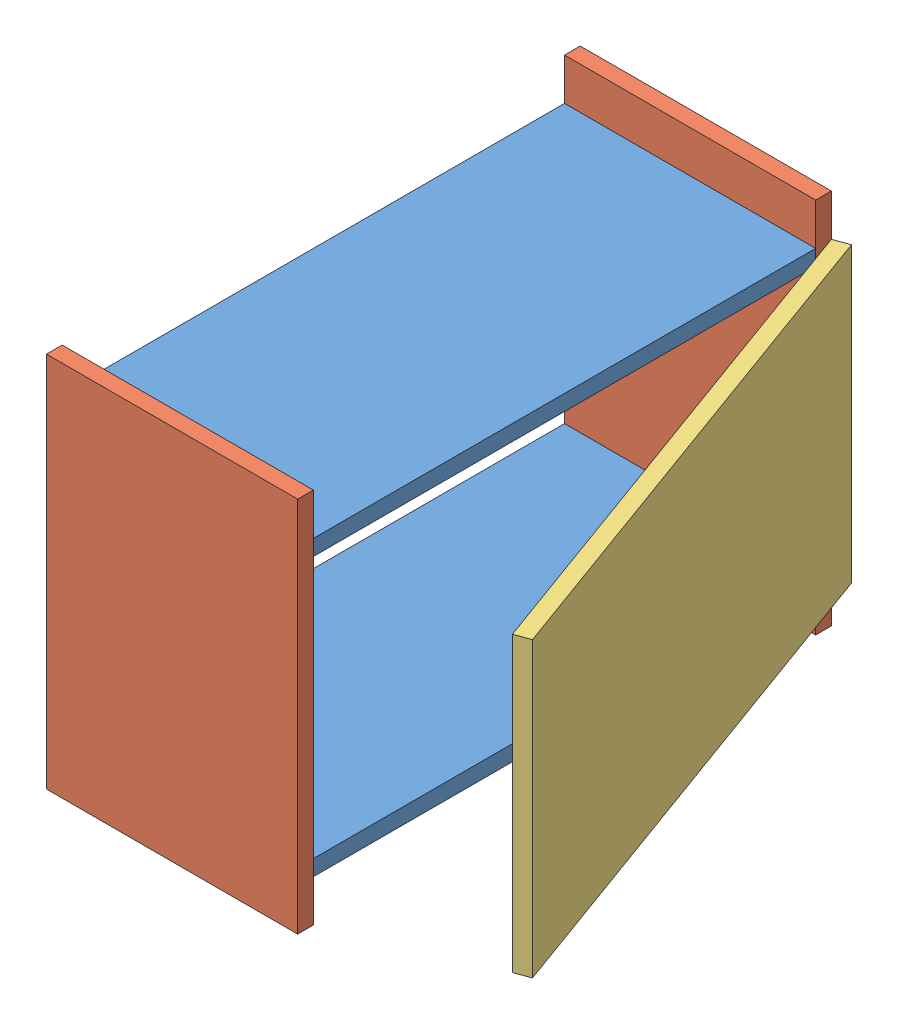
SolidWorks assembly Test.SLDASM, configuration Default (file format 11000). Lengths in mm.
Overall size (544.23 457.2 654.22).
5 component instances, 3 part files, 12 mates.
Components (placement in the parent):
- Test.12X24-2: Test.12X24.SLDPRT [Default] at origin size (304.8 19.05 609.6)
- Test.12X18-1: Test.12X18.SLDPRT [Default] at (0 -50.8 609.6) size (304.8 457.2 19.05)
- Test.12X18-2: Test.12X18.SLDPRT [Default] at (0 -50.8 -19.05) size (304.8 457.2 19.05)
- Test.12X24-3: Test.12X24.SLDPRT [Default] at (0 336.55 0) size (304.8 19.05 609.6)
- Test.14X25.5-1: Test.14X25.5.SLDPRT [Default] at (304.8 0 -19.05) x (0.939693 0 -0.34202) z (0.34202 0 0.939693) size (19.05 355.6 647.7)
Mates (geometry in assembly coordinates):
- Coincident1: coincident: plane of Test.12X24-2 through (0 19.05 609.6) normal (0 0 1); plane of Test.12X18-1 through (0 406.4 609.6) normal (0 0 -1)
- Coincident2: coincident: plane of Test.12X24-2 through (304.8 0 609.6) normal (1 0 0); plane of Test.12X18-1 through (304.8 -50.8 628.65) normal (1 0 0)
- Distance1: distance = 50.8 mm: plane of Test.12X18-1 through (0 -50.8 628.65) normal (0 -1 0); plane of Test.12X24-2 through (0 0 609.6) normal (0 -1 0)
- Coincident4: coincident: plane of Test.12X24-2 through (0 19.05 0) normal (0 0 -1); plane of Test.12X18-2 through (0 406.4 0) normal (0 0 1)
- Coincident5: coincident: plane of Test.12X24-2 through (304.8 0 609.6) normal (1 0 0); plane of Test.12X18-2 through (304.8 -50.8 0) normal (1 0 0)
- Coincident6: coincident: plane of Test.12X18-1 through (0 -50.8 628.65) normal (0 -1 0); plane of Test.12X18-2 through (0 -50.8 0) normal (0 -1 0)
- Coincident7: coincident: plane of Test.12X18-1 through (0 406.4 609.6) normal (0 0 -1); plane of Test.12X24-3 through (0 355.6 609.6) normal (0 0 1)
- Coincident8: coincident: plane of Test.12X18-1 through (304.8 -50.8 628.65) normal (1 0 0); plane of Test.12X24-3 through (304.8 336.55 609.6) normal (1 0 0)
- Distance2: distance = 50.8 mm: plane of Test.12X24-3 through (0 355.6 609.6) normal (0 1 0); plane of Test.12X18-1 through (0 406.4 628.65) normal (0 1 0)
- Coincident10: coincident: line of Test.12X18-2 through (304.8 -50.8 -19.05) axis (0 1 0); line of Test.14X25.5-1 through (304.8 355.6 -19.05) axis (0 -1 0)
- Coincident11: coincident: plane of Test.12X24-3 through (0 355.6 609.6) normal (0 1 0); plane of Test.14X25.5-1 through (526.3264 355.6 589.5889) normal (0 1 0)
- Angle1: planar angle = 2.792527 rad: plane of Test.12X24-3 through (304.8 336.55 609.6) normal (1 0 0); plane of Test.14X25.5-1 through (526.3264 0 589.5889) normal (-0.939693 0 0.34202)
